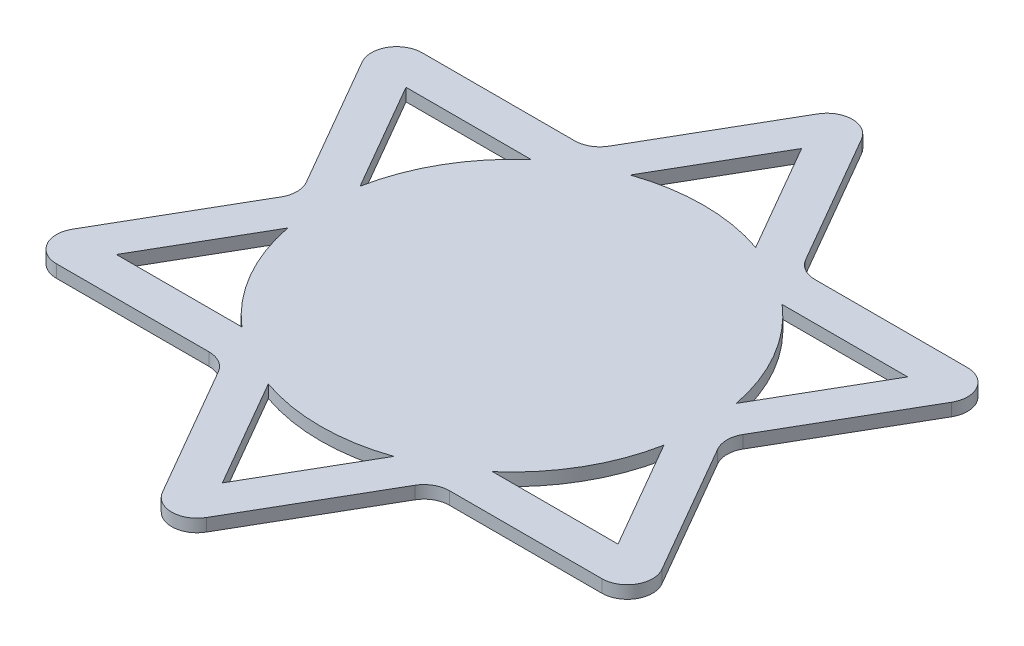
ISO-10303-21;
HEADER;
FILE_DESCRIPTION(('STEP AP214'),'2;1');
FILE_NAME('part.step','',(''),(''),'','','');
FILE_SCHEMA(('AUTOMOTIVE_DESIGN { 1 0 10303 214 1 1 1 1 }'));
ENDSEC;
DATA;
#1=APPLICATION_CONTEXT('core data for automotive mechanical design processes');
#2=APPLICATION_PROTOCOL_DEFINITION('international standard','automotive_design',2000,#1);
#3=PRODUCT_CONTEXT('',#1,'mechanical');
#4=PRODUCT('Part','Part','',(#3));
#5=PRODUCT_RELATED_PRODUCT_CATEGORY('part','',(#4));
#6=PRODUCT_DEFINITION_FORMATION('','',#4);
#7=PRODUCT_DEFINITION_CONTEXT('part definition',#1,'design');
#8=PRODUCT_DEFINITION('design','',#6,#7);
#9=PRODUCT_DEFINITION_SHAPE('','',#8);
#10=(LENGTH_UNIT() NAMED_UNIT(*) SI_UNIT(.MILLI.,.METRE.));
#11=(NAMED_UNIT(*) PLANE_ANGLE_UNIT() SI_UNIT($,.RADIAN.));
#12=(NAMED_UNIT(*) SI_UNIT($,.STERADIAN.) SOLID_ANGLE_UNIT());
#13=UNCERTAINTY_MEASURE_WITH_UNIT(LENGTH_MEASURE(1.E-05),#10,'distance_accuracy_value','');
#14=(GEOMETRIC_REPRESENTATION_CONTEXT(3) GLOBAL_UNCERTAINTY_ASSIGNED_CONTEXT((#13)) GLOBAL_UNIT_ASSIGNED_CONTEXT((#10,
#11,#12)) REPRESENTATION_CONTEXT('',''));
#15=CARTESIAN_POINT('',(0.,0.,0.));
#16=DIRECTION('',(0.,0.,1.));
#17=DIRECTION('',(1.,0.,0.));
#18=AXIS2_PLACEMENT_3D('',#15,#16,#17);
#19=CARTESIAN_POINT('',(53.4134542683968,1.,53.0877295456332));
#20=DIRECTION('',(0.,-1.,0.));
#21=DIRECTION('',(0.,0.,-1.));
#22=AXIS2_PLACEMENT_3D('',#19,#20,#21);
#23=PLANE('',#22);
#24=DIRECTION('',(-0.5,0.,0.866025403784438));
#25=VECTOR('',#24,1.);
#26=CARTESIAN_POINT('',(62.9014881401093,1.,46.6539728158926));
#27=LINE('',#26,#25);
#28=CARTESIAN_POINT('',(62.9014881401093,1.,46.6539728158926));
#29=VERTEX_POINT('',#28);
#30=CARTESIAN_POINT('',(57.9479405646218,1.,55.2337688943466));
#31=VERTEX_POINT('',#30);
#32=EDGE_CURVE('E327',#29,#31,#27,.T.);
#33=ORIENTED_EDGE('',*,*,#32,.F.);
#34=DIRECTION('',(-0.499999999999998,0.,-0.86602540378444));
#35=VECTOR('',#34,1.);
#36=CARTESIAN_POINT('',(62.9014881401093,1.,46.6539728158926));
#37=LINE('',#36,#35);
#38=CARTESIAN_POINT('',(67.8550357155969,1.,55.2337688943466));
#39=VERTEX_POINT('',#38);
#40=EDGE_CURVE('E333',#39,#29,#37,.T.);
#41=ORIENTED_EDGE('',*,*,#40,.F.);
#42=CARTESIAN_POINT('',(62.9014881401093,1.,69.5214862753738));
#43=DIRECTION('',(0.,-1.,0.));
#44=DIRECTION('',(0.,0.,1.));
#45=AXIS2_PLACEMENT_3D('',#42,#43,#44);
#46=CIRCLE('',#45,15.1220534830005);
#47=EDGE_CURVE('E329',#31,#39,#46,.T.);
#48=ORIENTED_EDGE('',*,*,#47,.F.);
#49=EDGE_LOOP('',(#33,#41,#48));
#50=FACE_BOUND('',#49,.T.);
#51=DIRECTION('',(-0.499999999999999,0.,-0.866025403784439));
#52=VECTOR('',#51,1.);
#53=CARTESIAN_POINT('',(77.7517881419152,1.,72.3754469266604));
#54=LINE('',#53,#52);
#55=CARTESIAN_POINT('',(82.7053357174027,1.,80.9552430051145));
#56=VERTEX_POINT('',#55);
#57=CARTESIAN_POINT('',(77.7517881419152,1.,72.3754469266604));
#58=VERTEX_POINT('',#57);
#59=EDGE_CURVE('E375',#56,#58,#54,.T.);
#60=ORIENTED_EDGE('',*,*,#59,.F.);
#61=DIRECTION('',(1.,0.,0.));
#62=VECTOR('',#61,1.);
#63=CARTESIAN_POINT('',(72.7982405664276,1.,80.9552430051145));
#64=LINE('',#63,#62);
#65=CARTESIAN_POINT('',(72.7982405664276,1.,80.9552430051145));
#66=VERTEX_POINT('',#65);
#67=EDGE_CURVE('E381',#66,#56,#64,.T.);
#68=ORIENTED_EDGE('',*,*,#67,.F.);
#69=CARTESIAN_POINT('',(62.9014881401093,1.,69.5214862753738));
#70=DIRECTION('',(0.,-1.,0.));
#71=DIRECTION('',(0.,0.,1.));
#72=AXIS2_PLACEMENT_3D('',#69,#70,#71);
#73=CIRCLE('',#72,15.1220534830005);
#74=EDGE_CURVE('E377',#58,#66,#73,.T.);
#75=ORIENTED_EDGE('',*,*,#74,.F.);
#76=EDGE_LOOP('',(#60,#68,#75));
#77=FACE_BOUND('',#76,.T.);
#78=DIRECTION('',(1.,0.,0.));
#79=VECTOR('',#78,1.);
#80=CARTESIAN_POINT('',(43.097640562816,1.,80.9552430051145));
#81=LINE('',#80,#79);
#82=CARTESIAN_POINT('',(43.097640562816,1.,80.9552430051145));
#83=VERTEX_POINT('',#82);
#84=CARTESIAN_POINT('',(53.004735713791,1.,80.9552430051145));
#85=VERTEX_POINT('',#84);
#86=EDGE_CURVE('E423',#83,#85,#81,.T.);
#87=ORIENTED_EDGE('',*,*,#86,.F.);
#88=DIRECTION('',(-0.5,0.,0.866025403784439));
#89=VECTOR('',#88,1.);
#90=CARTESIAN_POINT('',(48.0511881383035,1.,72.3754469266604));
#91=LINE('',#90,#89);
#92=CARTESIAN_POINT('',(48.0511881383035,1.,72.3754469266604));
#93=VERTEX_POINT('',#92);
#94=EDGE_CURVE('E429',#93,#83,#91,.T.);
#95=ORIENTED_EDGE('',*,*,#94,.F.);
#96=CARTESIAN_POINT('',(62.9014881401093,1.,69.5214862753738));
#97=DIRECTION('',(0.,-1.,0.));
#98=DIRECTION('',(0.,0.,1.));
#99=AXIS2_PLACEMENT_3D('',#96,#97,#98);
#100=CIRCLE('',#99,15.1220534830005);
#101=EDGE_CURVE('E425',#85,#93,#100,.T.);
#102=ORIENTED_EDGE('',*,*,#101,.F.);
#103=EDGE_LOOP('',(#87,#95,#102));
#104=FACE_BOUND('',#103,.T.);
#105=CARTESIAN_POINT('',(53.4134542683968,1.,53.0877295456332));
#106=DIRECTION('',(0.,-1.,0.));
#107=DIRECTION('',(0.,0.,-1.));
#108=AXIS2_PLACEMENT_3D('',#105,#106,#107);
#109=CIRCLE('',#108,2.);
#110=CARTESIAN_POINT('',(55.1455050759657,1.,54.0877295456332));
#111=VERTEX_POINT('',#110);
#112=CARTESIAN_POINT('',(53.4134542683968,1.,55.0877295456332));
#113=VERTEX_POINT('',#112);
#114=EDGE_CURVE('E447',#111,#113,#109,.T.);
#115=ORIENTED_EDGE('',*,*,#114,.T.);
#116=DIRECTION('',(-1.,0.,0.));
#117=VECTOR('',#116,1.);
#118=CARTESIAN_POINT('',(41.3655897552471,1.,55.0877295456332));
#119=LINE('',#118,#117);
#120=CARTESIAN_POINT('',(41.3655897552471,1.,55.0877295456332));
#121=VERTEX_POINT('',#120);
#122=EDGE_CURVE('E450',#113,#121,#119,.T.);
#123=ORIENTED_EDGE('',*,*,#122,.T.);
#124=CARTESIAN_POINT('',(41.3655897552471,1.,57.0877295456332));
#125=DIRECTION('',(0.,1.,0.));
#126=DIRECTION('',(0.,0.,-1.));
#127=AXIS2_PLACEMENT_3D('',#124,#125,#126);
#128=CIRCLE('',#127,2.);
#129=CARTESIAN_POINT('',(39.6335389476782,1.,58.0877295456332));
#130=VERTEX_POINT('',#129);
#131=EDGE_CURVE('E453',#121,#130,#128,.T.);
#132=ORIENTED_EDGE('',*,*,#131,.T.);
#133=DIRECTION('',(0.499999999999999,0.,0.866025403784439));
#134=VECTOR('',#133,1.);
#135=CARTESIAN_POINT('',(39.6335389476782,1.,58.0877295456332));
#136=LINE('',#135,#134);
#137=CARTESIAN_POINT('',(45.657471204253,1.,68.5214862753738));
#138=VERTEX_POINT('',#137);
#139=EDGE_CURVE('E455',#130,#138,#136,.T.);
#140=ORIENTED_EDGE('',*,*,#139,.T.);
#141=CARTESIAN_POINT('',(43.9254203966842,1.,69.5214862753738));
#142=DIRECTION('',(0.,-1.,0.));
#143=DIRECTION('',(0.,0.,1.));
#144=AXIS2_PLACEMENT_3D('',#141,#142,#143);
#145=CIRCLE('',#144,2.);
#146=CARTESIAN_POINT('',(45.657471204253,1.,70.5214862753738));
#147=VERTEX_POINT('',#146);
#148=EDGE_CURVE('E457',#138,#147,#145,.T.);
#149=ORIENTED_EDGE('',*,*,#148,.T.);
#150=DIRECTION('',(-0.499999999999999,0.,0.866025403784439));
#151=VECTOR('',#150,1.);
#152=CARTESIAN_POINT('',(45.657471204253,1.,70.5214862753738));
#153=LINE('',#152,#151);
#154=CARTESIAN_POINT('',(39.6335389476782,1.,80.9552430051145));
#155=VERTEX_POINT('',#154);
#156=EDGE_CURVE('E459',#147,#155,#153,.T.);
#157=ORIENTED_EDGE('',*,*,#156,.T.);
#158=CARTESIAN_POINT('',(41.3655897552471,1.,81.9552430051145));
#159=DIRECTION('',(0.,1.,0.));
#160=DIRECTION('',(0.,0.,-1.));
#161=AXIS2_PLACEMENT_3D('',#158,#159,#160);
#162=CIRCLE('',#161,2.);
#163=CARTESIAN_POINT('',(41.3655897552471,1.,83.9552430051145));
#164=VERTEX_POINT('',#163);
#165=EDGE_CURVE('E461',#155,#164,#162,.T.);
#166=ORIENTED_EDGE('',*,*,#165,.T.);
#167=DIRECTION('',(1.,0.,0.));
#168=VECTOR('',#167,1.);
#169=CARTESIAN_POINT('',(41.3655897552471,1.,83.9552430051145));
#170=LINE('',#169,#168);
#171=CARTESIAN_POINT('',(53.4134542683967,1.,83.9552430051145));
#172=VERTEX_POINT('',#171);
#173=EDGE_CURVE('E463',#164,#172,#170,.T.);
#174=ORIENTED_EDGE('',*,*,#173,.T.);
#175=CARTESIAN_POINT('',(53.4134542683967,1.,85.9552430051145));
#176=DIRECTION('',(0.,-1.,0.));
#177=DIRECTION('',(0.,0.,-1.));
#178=AXIS2_PLACEMENT_3D('',#175,#176,#177);
#179=CIRCLE('',#178,2.);
#180=CARTESIAN_POINT('',(55.1455050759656,1.,84.9552430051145));
#181=VERTEX_POINT('',#180);
#182=EDGE_CURVE('E465',#172,#181,#179,.T.);
#183=ORIENTED_EDGE('',*,*,#182,.T.);
#184=DIRECTION('',(0.499999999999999,0.,0.866025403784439));
#185=VECTOR('',#184,1.);
#186=CARTESIAN_POINT('',(55.1455050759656,1.,84.9552430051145));
#187=LINE('',#186,#185);
#188=CARTESIAN_POINT('',(61.1694373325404,1.,95.3889997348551));
#189=VERTEX_POINT('',#188);
#190=EDGE_CURVE('E467',#181,#189,#187,.T.);
#191=ORIENTED_EDGE('',*,*,#190,.T.);
#192=CARTESIAN_POINT('',(62.9014881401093,1.,94.3889997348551));
#193=DIRECTION('',(0.,1.,0.));
#194=DIRECTION('',(0.,0.,-1.));
#195=AXIS2_PLACEMENT_3D('',#192,#193,#194);
#196=CIRCLE('',#195,2.);
#197=CARTESIAN_POINT('',(64.6335389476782,1.,95.3889997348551));
#198=VERTEX_POINT('',#197);
#199=EDGE_CURVE('E469',#189,#198,#196,.T.);
#200=ORIENTED_EDGE('',*,*,#199,.T.);
#201=DIRECTION('',(0.5,0.,-0.866025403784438));
#202=VECTOR('',#201,1.);
#203=CARTESIAN_POINT('',(70.657471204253,1.,84.9552430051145));
#204=LINE('',#203,#202);
#205=CARTESIAN_POINT('',(70.657471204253,1.,84.9552430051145));
#206=VERTEX_POINT('',#205);
#207=EDGE_CURVE('E471',#198,#206,#204,.T.);
#208=ORIENTED_EDGE('',*,*,#207,.T.);
#209=CARTESIAN_POINT('',(72.3895220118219,1.,85.9552430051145));
#210=DIRECTION('',(0.,-1.,0.));
#211=DIRECTION('',(0.,0.,1.));
#212=AXIS2_PLACEMENT_3D('',#209,#210,#211);
#213=CIRCLE('',#212,2.);
#214=CARTESIAN_POINT('',(72.3895220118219,1.,83.9552430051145));
#215=VERTEX_POINT('',#214);
#216=EDGE_CURVE('E473',#206,#215,#213,.T.);
#217=ORIENTED_EDGE('',*,*,#216,.T.);
#218=DIRECTION('',(1.,0.,0.));
#219=VECTOR('',#218,1.);
#220=CARTESIAN_POINT('',(72.3895220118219,1.,83.9552430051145));
#221=LINE('',#220,#219);
#222=CARTESIAN_POINT('',(84.4373865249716,1.,83.9552430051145));
#223=VERTEX_POINT('',#222);
#224=EDGE_CURVE('E475',#215,#223,#221,.T.);
#225=ORIENTED_EDGE('',*,*,#224,.T.);
#226=CARTESIAN_POINT('',(84.4373865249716,1.,81.9552430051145));
#227=DIRECTION('',(0.,1.,0.));
#228=DIRECTION('',(0.,0.,-1.));
#229=AXIS2_PLACEMENT_3D('',#226,#227,#228);
#230=CIRCLE('',#229,2.00000000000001);
#231=CARTESIAN_POINT('',(86.1694373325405,1.,80.9552430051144));
#232=VERTEX_POINT('',#231);
#233=EDGE_CURVE('E477',#223,#232,#230,.T.);
#234=ORIENTED_EDGE('',*,*,#233,.T.);
#235=DIRECTION('',(-0.5,0.,-0.866025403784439));
#236=VECTOR('',#235,1.);
#237=CARTESIAN_POINT('',(80.1455050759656,1.,70.5214862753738));
#238=LINE('',#237,#236);
#239=CARTESIAN_POINT('',(80.1455050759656,1.,70.5214862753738));
#240=VERTEX_POINT('',#239);
#241=EDGE_CURVE('E479',#232,#240,#238,.T.);
#242=ORIENTED_EDGE('',*,*,#241,.T.);
#243=CARTESIAN_POINT('',(81.8775558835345,1.,69.5214862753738));
#244=DIRECTION('',(0.,-1.,0.));
#245=DIRECTION('',(0.,0.,-1.));
#246=AXIS2_PLACEMENT_3D('',#243,#244,#245);
#247=CIRCLE('',#246,2.);
#248=CARTESIAN_POINT('',(80.1455050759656,1.,68.5214862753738));
#249=VERTEX_POINT('',#248);
#250=EDGE_CURVE('E481',#240,#249,#247,.T.);
#251=ORIENTED_EDGE('',*,*,#250,.T.);
#252=DIRECTION('',(0.500000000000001,0.,-0.866025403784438));
#253=VECTOR('',#252,1.);
#254=CARTESIAN_POINT('',(86.1694373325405,1.,58.0877295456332));
#255=LINE('',#254,#253);
#256=CARTESIAN_POINT('',(86.1694373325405,1.,58.0877295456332));
#257=VERTEX_POINT('',#256);
#258=EDGE_CURVE('E483',#249,#257,#255,.T.);
#259=ORIENTED_EDGE('',*,*,#258,.T.);
#260=CARTESIAN_POINT('',(84.4373865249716,1.,57.0877295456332));
#261=DIRECTION('',(0.,1.,0.));
#262=DIRECTION('',(0.,0.,-1.));
#263=AXIS2_PLACEMENT_3D('',#260,#261,#262);
#264=CIRCLE('',#263,2.);
#265=CARTESIAN_POINT('',(84.4373865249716,1.,55.0877295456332));
#266=VERTEX_POINT('',#265);
#267=EDGE_CURVE('E485',#257,#266,#264,.T.);
#268=ORIENTED_EDGE('',*,*,#267,.T.);
#269=DIRECTION('',(-1.,0.,0.));
#270=VECTOR('',#269,1.);
#271=CARTESIAN_POINT('',(72.3895220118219,1.,55.0877295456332));
#272=LINE('',#271,#270);
#273=CARTESIAN_POINT('',(72.3895220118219,1.,55.0877295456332));
#274=VERTEX_POINT('',#273);
#275=EDGE_CURVE('E487',#266,#274,#272,.T.);
#276=ORIENTED_EDGE('',*,*,#275,.T.);
#277=CARTESIAN_POINT('',(72.3895220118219,1.,53.0877295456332));
#278=DIRECTION('',(0.,-1.,0.));
#279=DIRECTION('',(0.,0.,-1.));
#280=AXIS2_PLACEMENT_3D('',#277,#278,#279);
#281=CIRCLE('',#280,2.);
#282=CARTESIAN_POINT('',(70.657471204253,1.,54.0877295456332));
#283=VERTEX_POINT('',#282);
#284=EDGE_CURVE('E489',#274,#283,#281,.T.);
#285=ORIENTED_EDGE('',*,*,#284,.T.);
#286=DIRECTION('',(-0.5,0.,-0.866025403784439));
#287=VECTOR('',#286,1.);
#288=CARTESIAN_POINT('',(64.6335389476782,1.,43.6539728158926));
#289=LINE('',#288,#287);
#290=CARTESIAN_POINT('',(64.6335389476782,1.,43.6539728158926));
#291=VERTEX_POINT('',#290);
#292=EDGE_CURVE('E491',#283,#291,#289,.T.);
#293=ORIENTED_EDGE('',*,*,#292,.T.);
#294=CARTESIAN_POINT('',(62.9014881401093,1.,44.6539728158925));
#295=DIRECTION('',(0.,1.,0.));
#296=DIRECTION('',(0.,0.,-1.));
#297=AXIS2_PLACEMENT_3D('',#294,#295,#296);
#298=CIRCLE('',#297,2.);
#299=CARTESIAN_POINT('',(61.1694373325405,1.,43.6539728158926));
#300=VERTEX_POINT('',#299);
#301=EDGE_CURVE('E493',#291,#300,#298,.T.);
#302=ORIENTED_EDGE('',*,*,#301,.T.);
#303=DIRECTION('',(-0.5,0.,0.866025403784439));
#304=VECTOR('',#303,1.);
#305=CARTESIAN_POINT('',(61.1694373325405,1.,43.6539728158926));
#306=LINE('',#305,#304);
#307=EDGE_CURVE('E495',#300,#111,#306,.T.);
#308=ORIENTED_EDGE('',*,*,#307,.T.);
#309=EDGE_LOOP('',(#115,#123,#132,#140,#149,#157,#166,#174,#183,#191,#200,#208,#217,#225,#234,
#242,#251,#259,#268,#276,#285,#293,#302,#308));
#310=FACE_BOUND('',#309,.T.);
#311=DIRECTION('',(0.5,0.,-0.866025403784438));
#312=VECTOR('',#311,1.);
#313=CARTESIAN_POINT('',(67.8550357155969,1.,83.8092036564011));
#314=LINE('',#313,#312);
#315=CARTESIAN_POINT('',(62.9014881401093,1.,92.3889997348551));
#316=VERTEX_POINT('',#315);
#317=CARTESIAN_POINT('',(67.8550357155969,1.,83.8092036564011));
#318=VERTEX_POINT('',#317);
#319=EDGE_CURVE('E399',#316,#318,#314,.T.);
#320=ORIENTED_EDGE('',*,*,#319,.F.);
#321=DIRECTION('',(0.500000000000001,0.,0.866025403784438));
#322=VECTOR('',#321,1.);
#323=CARTESIAN_POINT('',(57.9479405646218,1.,83.8092036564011));
#324=LINE('',#323,#322);
#325=CARTESIAN_POINT('',(57.9479405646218,1.,83.8092036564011));
#326=VERTEX_POINT('',#325);
#327=EDGE_CURVE('E405',#326,#316,#324,.T.);
#328=ORIENTED_EDGE('',*,*,#327,.F.);
#329=CARTESIAN_POINT('',(62.9014881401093,1.,69.5214862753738));
#330=DIRECTION('',(0.,-1.,0.));
#331=DIRECTION('',(0.,0.,1.));
#332=AXIS2_PLACEMENT_3D('',#329,#330,#331);
#333=CIRCLE('',#332,15.1220534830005);
#334=EDGE_CURVE('E401',#318,#326,#333,.T.);
#335=ORIENTED_EDGE('',*,*,#334,.F.);
#336=EDGE_LOOP('',(#320,#328,#335));
#337=FACE_BOUND('',#336,.T.);
#338=DIRECTION('',(-1.,0.,0.));
#339=VECTOR('',#338,1.);
#340=CARTESIAN_POINT('',(72.7982405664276,1.,58.0877295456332));
#341=LINE('',#340,#339);
#342=CARTESIAN_POINT('',(82.7053357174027,1.,58.0877295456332));
#343=VERTEX_POINT('',#342);
#344=CARTESIAN_POINT('',(72.7982405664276,1.,58.0877295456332));
#345=VERTEX_POINT('',#344);
#346=EDGE_CURVE('E351',#343,#345,#341,.T.);
#347=ORIENTED_EDGE('',*,*,#346,.F.);
#348=DIRECTION('',(0.500000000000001,0.,-0.866025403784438));
#349=VECTOR('',#348,1.);
#350=CARTESIAN_POINT('',(82.7053357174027,1.,58.0877295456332));
#351=LINE('',#350,#349);
#352=CARTESIAN_POINT('',(77.7517881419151,1.,66.6675256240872));
#353=VERTEX_POINT('',#352);
#354=EDGE_CURVE('E357',#353,#343,#351,.T.);
#355=ORIENTED_EDGE('',*,*,#354,.F.);
#356=CARTESIAN_POINT('',(62.9014881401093,1.,69.5214862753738));
#357=DIRECTION('',(0.,-1.,0.));
#358=DIRECTION('',(0.,0.,1.));
#359=AXIS2_PLACEMENT_3D('',#356,#357,#358);
#360=CIRCLE('',#359,15.1220534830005);
#361=EDGE_CURVE('E353',#345,#353,#360,.T.);
#362=ORIENTED_EDGE('',*,*,#361,.F.);
#363=EDGE_LOOP('',(#347,#355,#362));
#364=FACE_BOUND('',#363,.T.);
#365=DIRECTION('',(0.5,0.,0.866025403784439));
#366=VECTOR('',#365,1.);
#367=CARTESIAN_POINT('',(43.097640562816,1.,58.0877295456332));
#368=LINE('',#367,#366);
#369=CARTESIAN_POINT('',(43.097640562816,1.,58.0877295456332));
#370=VERTEX_POINT('',#369);
#371=CARTESIAN_POINT('',(48.0511881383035,1.,66.6675256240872));
#372=VERTEX_POINT('',#371);
#373=EDGE_CURVE('E300',#370,#372,#368,.T.);
#374=ORIENTED_EDGE('',*,*,#373,.F.);
#375=DIRECTION('',(-1.,0.,0.));
#376=VECTOR('',#375,1.);
#377=CARTESIAN_POINT('',(43.097640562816,1.,58.0877295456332));
#378=LINE('',#377,#376);
#379=CARTESIAN_POINT('',(53.004735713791,1.,58.0877295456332));
#380=VERTEX_POINT('',#379);
#381=EDGE_CURVE('E317',#380,#370,#378,.T.);
#382=ORIENTED_EDGE('',*,*,#381,.F.);
#383=CARTESIAN_POINT('',(62.9014881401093,1.,69.5214862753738));
#384=DIRECTION('',(0.,-1.,0.));
#385=DIRECTION('',(0.,0.,1.));
#386=AXIS2_PLACEMENT_3D('',#383,#384,#385);
#387=CIRCLE('',#386,15.1220534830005);
#388=EDGE_CURVE('E308',#372,#380,#387,.T.);
#389=ORIENTED_EDGE('',*,*,#388,.F.);
#390=EDGE_LOOP('',(#374,#382,#389));
#391=FACE_BOUND('',#390,.T.);
#392=ADVANCED_FACE('F31',(#50,#77,#104,#310,#337,#364,#391),#23,.F.);
#393=CARTESIAN_POINT('',(53.4134542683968,0.,53.0877295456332));
#394=DIRECTION('',(0.,-1.,0.));
#395=DIRECTION('',(0.,0.,-1.));
#396=AXIS2_PLACEMENT_3D('',#393,#394,#395);
#397=PLANE('',#396);
#398=DIRECTION('',(-0.499999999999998,0.,-0.86602540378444));
#399=VECTOR('',#398,1.);
#400=CARTESIAN_POINT('',(62.9014881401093,0.,46.6539728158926));
#401=LINE('',#400,#399);
#402=CARTESIAN_POINT('',(67.8550357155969,0.,55.2337688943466));
#403=VERTEX_POINT('',#402);
#404=CARTESIAN_POINT('',(62.9014881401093,0.,46.6539728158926));
#405=VERTEX_POINT('',#404);
#406=EDGE_CURVE('E330',#403,#405,#401,.T.);
#407=ORIENTED_EDGE('',*,*,#406,.T.);
#408=DIRECTION('',(-0.5,0.,0.866025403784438));
#409=VECTOR('',#408,1.);
#410=CARTESIAN_POINT('',(62.9014881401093,0.,46.6539728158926));
#411=LINE('',#410,#409);
#412=CARTESIAN_POINT('',(57.9479405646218,0.,55.2337688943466));
#413=VERTEX_POINT('',#412);
#414=EDGE_CURVE('E315',#405,#413,#411,.T.);
#415=ORIENTED_EDGE('',*,*,#414,.T.);
#416=CARTESIAN_POINT('',(62.9014881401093,0.,69.5214862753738));
#417=DIRECTION('',(0.,-1.,0.));
#418=DIRECTION('',(0.,0.,1.));
#419=AXIS2_PLACEMENT_3D('',#416,#417,#418);
#420=CIRCLE('',#419,15.1220534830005);
#421=EDGE_CURVE('E338',#413,#403,#420,.T.);
#422=ORIENTED_EDGE('',*,*,#421,.T.);
#423=EDGE_LOOP('',(#407,#415,#422));
#424=FACE_BOUND('',#423,.T.);
#425=DIRECTION('',(1.,0.,0.));
#426=VECTOR('',#425,1.);
#427=CARTESIAN_POINT('',(72.7982405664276,0.,80.9552430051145));
#428=LINE('',#427,#426);
#429=CARTESIAN_POINT('',(72.7982405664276,0.,80.9552430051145));
#430=VERTEX_POINT('',#429);
#431=CARTESIAN_POINT('',(82.7053357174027,0.,80.9552430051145));
#432=VERTEX_POINT('',#431);
#433=EDGE_CURVE('E378',#430,#432,#428,.T.);
#434=ORIENTED_EDGE('',*,*,#433,.T.);
#435=DIRECTION('',(-0.499999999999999,0.,-0.866025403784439));
#436=VECTOR('',#435,1.);
#437=CARTESIAN_POINT('',(77.7517881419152,0.,72.3754469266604));
#438=LINE('',#437,#436);
#439=CARTESIAN_POINT('',(77.7517881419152,0.,72.3754469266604));
#440=VERTEX_POINT('',#439);
#441=EDGE_CURVE('E374',#432,#440,#438,.T.);
#442=ORIENTED_EDGE('',*,*,#441,.T.);
#443=CARTESIAN_POINT('',(62.9014881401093,0.,69.5214862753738));
#444=DIRECTION('',(0.,-1.,0.));
#445=DIRECTION('',(0.,0.,1.));
#446=AXIS2_PLACEMENT_3D('',#443,#444,#445);
#447=CIRCLE('',#446,15.1220534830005);
#448=EDGE_CURVE('E386',#440,#430,#447,.T.);
#449=ORIENTED_EDGE('',*,*,#448,.T.);
#450=EDGE_LOOP('',(#434,#442,#449));
#451=FACE_BOUND('',#450,.T.);
#452=DIRECTION('',(-0.5,0.,0.866025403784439));
#453=VECTOR('',#452,1.);
#454=CARTESIAN_POINT('',(48.0511881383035,0.,72.3754469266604));
#455=LINE('',#454,#453);
#456=CARTESIAN_POINT('',(48.0511881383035,0.,72.3754469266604));
#457=VERTEX_POINT('',#456);
#458=CARTESIAN_POINT('',(43.097640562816,0.,80.9552430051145));
#459=VERTEX_POINT('',#458);
#460=EDGE_CURVE('E426',#457,#459,#455,.T.);
#461=ORIENTED_EDGE('',*,*,#460,.T.);
#462=DIRECTION('',(1.,0.,0.));
#463=VECTOR('',#462,1.);
#464=CARTESIAN_POINT('',(43.097640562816,0.,80.9552430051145));
#465=LINE('',#464,#463);
#466=CARTESIAN_POINT('',(53.004735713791,0.,80.9552430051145));
#467=VERTEX_POINT('',#466);
#468=EDGE_CURVE('E422',#459,#467,#465,.T.);
#469=ORIENTED_EDGE('',*,*,#468,.T.);
#470=CARTESIAN_POINT('',(62.9014881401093,0.,69.5214862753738));
#471=DIRECTION('',(0.,-1.,0.));
#472=DIRECTION('',(0.,0.,1.));
#473=AXIS2_PLACEMENT_3D('',#470,#471,#472);
#474=CIRCLE('',#473,15.1220534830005);
#475=EDGE_CURVE('E434',#467,#457,#474,.T.);
#476=ORIENTED_EDGE('',*,*,#475,.T.);
#477=EDGE_LOOP('',(#461,#469,#476));
#478=FACE_BOUND('',#477,.T.);
#479=CARTESIAN_POINT('',(53.4134542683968,0.,53.0877295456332));
#480=DIRECTION('',(0.,-1.,0.));
#481=DIRECTION('',(0.,0.,-1.));
#482=AXIS2_PLACEMENT_3D('',#479,#480,#481);
#483=CIRCLE('',#482,2.);
#484=CARTESIAN_POINT('',(55.1455050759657,0.,54.0877295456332));
#485=VERTEX_POINT('',#484);
#486=CARTESIAN_POINT('',(53.4134542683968,0.,55.0877295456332));
#487=VERTEX_POINT('',#486);
#488=EDGE_CURVE('E446',#485,#487,#483,.T.);
#489=ORIENTED_EDGE('',*,*,#488,.F.);
#490=DIRECTION('',(-0.5,0.,0.866025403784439));
#491=VECTOR('',#490,1.);
#492=CARTESIAN_POINT('',(61.1694373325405,0.,43.6539728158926));
#493=LINE('',#492,#491);
#494=CARTESIAN_POINT('',(61.1694373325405,0.,43.6539728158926));
#495=VERTEX_POINT('',#494);
#496=EDGE_CURVE('E451',#495,#485,#493,.T.);
#497=ORIENTED_EDGE('',*,*,#496,.F.);
#498=CARTESIAN_POINT('',(62.9014881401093,0.,44.6539728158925));
#499=DIRECTION('',(0.,1.,0.));
#500=DIRECTION('',(0.,0.,-1.));
#501=AXIS2_PLACEMENT_3D('',#498,#499,#500);
#502=CIRCLE('',#501,2.);
#503=CARTESIAN_POINT('',(64.6335389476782,0.,43.6539728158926));
#504=VERTEX_POINT('',#503);
#505=EDGE_CURVE('E542',#504,#495,#502,.T.);
#506=ORIENTED_EDGE('',*,*,#505,.F.);
#507=DIRECTION('',(-0.5,0.,-0.866025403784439));
#508=VECTOR('',#507,1.);
#509=CARTESIAN_POINT('',(64.6335389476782,0.,43.6539728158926));
#510=LINE('',#509,#508);
#511=CARTESIAN_POINT('',(70.657471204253,0.,54.0877295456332));
#512=VERTEX_POINT('',#511);
#513=EDGE_CURVE('E540',#512,#504,#510,.T.);
#514=ORIENTED_EDGE('',*,*,#513,.F.);
#515=CARTESIAN_POINT('',(72.3895220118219,0.,53.0877295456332));
#516=DIRECTION('',(0.,-1.,0.));
#517=DIRECTION('',(0.,0.,-1.));
#518=AXIS2_PLACEMENT_3D('',#515,#516,#517);
#519=CIRCLE('',#518,2.);
#520=CARTESIAN_POINT('',(72.3895220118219,0.,55.0877295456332));
#521=VERTEX_POINT('',#520);
#522=EDGE_CURVE('E538',#521,#512,#519,.T.);
#523=ORIENTED_EDGE('',*,*,#522,.F.);
#524=DIRECTION('',(-1.,0.,0.));
#525=VECTOR('',#524,1.);
#526=CARTESIAN_POINT('',(72.3895220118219,0.,55.0877295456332));
#527=LINE('',#526,#525);
#528=CARTESIAN_POINT('',(84.4373865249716,0.,55.0877295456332));
#529=VERTEX_POINT('',#528);
#530=EDGE_CURVE('E536',#529,#521,#527,.T.);
#531=ORIENTED_EDGE('',*,*,#530,.F.);
#532=CARTESIAN_POINT('',(84.4373865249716,0.,57.0877295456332));
#533=DIRECTION('',(0.,1.,0.));
#534=DIRECTION('',(0.,0.,-1.));
#535=AXIS2_PLACEMENT_3D('',#532,#533,#534);
#536=CIRCLE('',#535,2.);
#537=CARTESIAN_POINT('',(86.1694373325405,0.,58.0877295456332));
#538=VERTEX_POINT('',#537);
#539=EDGE_CURVE('E534',#538,#529,#536,.T.);
#540=ORIENTED_EDGE('',*,*,#539,.F.);
#541=DIRECTION('',(0.500000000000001,0.,-0.866025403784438));
#542=VECTOR('',#541,1.);
#543=CARTESIAN_POINT('',(86.1694373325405,0.,58.0877295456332));
#544=LINE('',#543,#542);
#545=CARTESIAN_POINT('',(80.1455050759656,0.,68.5214862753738));
#546=VERTEX_POINT('',#545);
#547=EDGE_CURVE('E532',#546,#538,#544,.T.);
#548=ORIENTED_EDGE('',*,*,#547,.F.);
#549=CARTESIAN_POINT('',(81.8775558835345,0.,69.5214862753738));
#550=DIRECTION('',(0.,-1.,0.));
#551=DIRECTION('',(0.,0.,-1.));
#552=AXIS2_PLACEMENT_3D('',#549,#550,#551);
#553=CIRCLE('',#552,2.);
#554=CARTESIAN_POINT('',(80.1455050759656,0.,70.5214862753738));
#555=VERTEX_POINT('',#554);
#556=EDGE_CURVE('E530',#555,#546,#553,.T.);
#557=ORIENTED_EDGE('',*,*,#556,.F.);
#558=DIRECTION('',(-0.5,0.,-0.866025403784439));
#559=VECTOR('',#558,1.);
#560=CARTESIAN_POINT('',(80.1455050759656,0.,70.5214862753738));
#561=LINE('',#560,#559);
#562=CARTESIAN_POINT('',(86.1694373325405,0.,80.9552430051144));
#563=VERTEX_POINT('',#562);
#564=EDGE_CURVE('E528',#563,#555,#561,.T.);
#565=ORIENTED_EDGE('',*,*,#564,.F.);
#566=CARTESIAN_POINT('',(84.4373865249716,0.,81.9552430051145));
#567=DIRECTION('',(0.,1.,0.));
#568=DIRECTION('',(0.,0.,-1.));
#569=AXIS2_PLACEMENT_3D('',#566,#567,#568);
#570=CIRCLE('',#569,2.00000000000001);
#571=CARTESIAN_POINT('',(84.4373865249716,0.,83.9552430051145));
#572=VERTEX_POINT('',#571);
#573=EDGE_CURVE('E526',#572,#563,#570,.T.);
#574=ORIENTED_EDGE('',*,*,#573,.F.);
#575=DIRECTION('',(1.,0.,0.));
#576=VECTOR('',#575,1.);
#577=CARTESIAN_POINT('',(72.3895220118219,0.,83.9552430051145));
#578=LINE('',#577,#576);
#579=CARTESIAN_POINT('',(72.3895220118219,0.,83.9552430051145));
#580=VERTEX_POINT('',#579);
#581=EDGE_CURVE('E524',#580,#572,#578,.T.);
#582=ORIENTED_EDGE('',*,*,#581,.F.);
#583=CARTESIAN_POINT('',(72.3895220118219,0.,85.9552430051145));
#584=DIRECTION('',(0.,-1.,0.));
#585=DIRECTION('',(0.,0.,1.));
#586=AXIS2_PLACEMENT_3D('',#583,#584,#585);
#587=CIRCLE('',#586,2.);
#588=CARTESIAN_POINT('',(70.657471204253,0.,84.9552430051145));
#589=VERTEX_POINT('',#588);
#590=EDGE_CURVE('E522',#589,#580,#587,.T.);
#591=ORIENTED_EDGE('',*,*,#590,.F.);
#592=DIRECTION('',(0.5,0.,-0.866025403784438));
#593=VECTOR('',#592,1.);
#594=CARTESIAN_POINT('',(70.657471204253,0.,84.9552430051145));
#595=LINE('',#594,#593);
#596=CARTESIAN_POINT('',(64.6335389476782,0.,95.3889997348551));
#597=VERTEX_POINT('',#596);
#598=EDGE_CURVE('E520',#597,#589,#595,.T.);
#599=ORIENTED_EDGE('',*,*,#598,.F.);
#600=CARTESIAN_POINT('',(62.9014881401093,0.,94.3889997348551));
#601=DIRECTION('',(0.,1.,0.));
#602=DIRECTION('',(0.,0.,-1.));
#603=AXIS2_PLACEMENT_3D('',#600,#601,#602);
#604=CIRCLE('',#603,2.);
#605=CARTESIAN_POINT('',(61.1694373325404,0.,95.3889997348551));
#606=VERTEX_POINT('',#605);
#607=EDGE_CURVE('E518',#606,#597,#604,.T.);
#608=ORIENTED_EDGE('',*,*,#607,.F.);
#609=DIRECTION('',(0.499999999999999,0.,0.866025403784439));
#610=VECTOR('',#609,1.);
#611=CARTESIAN_POINT('',(55.1455050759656,0.,84.9552430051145));
#612=LINE('',#611,#610);
#613=CARTESIAN_POINT('',(55.1455050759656,0.,84.9552430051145));
#614=VERTEX_POINT('',#613);
#615=EDGE_CURVE('E516',#614,#606,#612,.T.);
#616=ORIENTED_EDGE('',*,*,#615,.F.);
#617=CARTESIAN_POINT('',(53.4134542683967,0.,85.9552430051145));
#618=DIRECTION('',(0.,-1.,0.));
#619=DIRECTION('',(0.,0.,-1.));
#620=AXIS2_PLACEMENT_3D('',#617,#618,#619);
#621=CIRCLE('',#620,2.);
#622=CARTESIAN_POINT('',(53.4134542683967,0.,83.9552430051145));
#623=VERTEX_POINT('',#622);
#624=EDGE_CURVE('E514',#623,#614,#621,.T.);
#625=ORIENTED_EDGE('',*,*,#624,.F.);
#626=DIRECTION('',(1.,0.,0.));
#627=VECTOR('',#626,1.);
#628=CARTESIAN_POINT('',(41.3655897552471,0.,83.9552430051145));
#629=LINE('',#628,#627);
#630=CARTESIAN_POINT('',(41.3655897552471,0.,83.9552430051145));
#631=VERTEX_POINT('',#630);
#632=EDGE_CURVE('E512',#631,#623,#629,.T.);
#633=ORIENTED_EDGE('',*,*,#632,.F.);
#634=CARTESIAN_POINT('',(41.3655897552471,0.,81.9552430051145));
#635=DIRECTION('',(0.,1.,0.));
#636=DIRECTION('',(0.,0.,-1.));
#637=AXIS2_PLACEMENT_3D('',#634,#635,#636);
#638=CIRCLE('',#637,2.);
#639=CARTESIAN_POINT('',(39.6335389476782,0.,80.9552430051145));
#640=VERTEX_POINT('',#639);
#641=EDGE_CURVE('E510',#640,#631,#638,.T.);
#642=ORIENTED_EDGE('',*,*,#641,.F.);
#643=DIRECTION('',(-0.499999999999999,0.,0.866025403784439));
#644=VECTOR('',#643,1.);
#645=CARTESIAN_POINT('',(45.657471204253,0.,70.5214862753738));
#646=LINE('',#645,#644);
#647=CARTESIAN_POINT('',(45.657471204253,0.,70.5214862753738));
#648=VERTEX_POINT('',#647);
#649=EDGE_CURVE('E508',#648,#640,#646,.T.);
#650=ORIENTED_EDGE('',*,*,#649,.F.);
#651=CARTESIAN_POINT('',(43.9254203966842,0.,69.5214862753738));
#652=DIRECTION('',(0.,-1.,0.));
#653=DIRECTION('',(0.,0.,1.));
#654=AXIS2_PLACEMENT_3D('',#651,#652,#653);
#655=CIRCLE('',#654,2.);
#656=CARTESIAN_POINT('',(45.657471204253,0.,68.5214862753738));
#657=VERTEX_POINT('',#656);
#658=EDGE_CURVE('E506',#657,#648,#655,.T.);
#659=ORIENTED_EDGE('',*,*,#658,.F.);
#660=DIRECTION('',(0.499999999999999,0.,0.866025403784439));
#661=VECTOR('',#660,1.);
#662=CARTESIAN_POINT('',(39.6335389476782,0.,58.0877295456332));
#663=LINE('',#662,#661);
#664=CARTESIAN_POINT('',(39.6335389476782,0.,58.0877295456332));
#665=VERTEX_POINT('',#664);
#666=EDGE_CURVE('E504',#665,#657,#663,.T.);
#667=ORIENTED_EDGE('',*,*,#666,.F.);
#668=CARTESIAN_POINT('',(41.3655897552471,0.,57.0877295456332));
#669=DIRECTION('',(0.,1.,0.));
#670=DIRECTION('',(0.,0.,-1.));
#671=AXIS2_PLACEMENT_3D('',#668,#669,#670);
#672=CIRCLE('',#671,2.);
#673=CARTESIAN_POINT('',(41.3655897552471,0.,55.0877295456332));
#674=VERTEX_POINT('',#673);
#675=EDGE_CURVE('E502',#674,#665,#672,.T.);
#676=ORIENTED_EDGE('',*,*,#675,.F.);
#677=DIRECTION('',(-1.,0.,0.));
#678=VECTOR('',#677,1.);
#679=CARTESIAN_POINT('',(41.3655897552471,0.,55.0877295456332));
#680=LINE('',#679,#678);
#681=EDGE_CURVE('E500',#487,#674,#680,.T.);
#682=ORIENTED_EDGE('',*,*,#681,.F.);
#683=EDGE_LOOP('',(#489,#497,#506,#514,#523,#531,#540,#548,#557,#565,#574,#582,#591,#599,#608,
#616,#625,#633,#642,#650,#659,#667,#676,#682));
#684=FACE_BOUND('',#683,.T.);
#685=DIRECTION('',(0.500000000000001,0.,0.866025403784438));
#686=VECTOR('',#685,1.);
#687=CARTESIAN_POINT('',(57.9479405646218,0.,83.8092036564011));
#688=LINE('',#687,#686);
#689=CARTESIAN_POINT('',(57.9479405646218,0.,83.8092036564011));
#690=VERTEX_POINT('',#689);
#691=CARTESIAN_POINT('',(62.9014881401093,0.,92.3889997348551));
#692=VERTEX_POINT('',#691);
#693=EDGE_CURVE('E402',#690,#692,#688,.T.);
#694=ORIENTED_EDGE('',*,*,#693,.T.);
#695=DIRECTION('',(0.5,0.,-0.866025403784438));
#696=VECTOR('',#695,1.);
#697=CARTESIAN_POINT('',(67.8550357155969,0.,83.8092036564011));
#698=LINE('',#697,#696);
#699=CARTESIAN_POINT('',(67.8550357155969,0.,83.8092036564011));
#700=VERTEX_POINT('',#699);
#701=EDGE_CURVE('E398',#692,#700,#698,.T.);
#702=ORIENTED_EDGE('',*,*,#701,.T.);
#703=CARTESIAN_POINT('',(62.9014881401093,0.,69.5214862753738));
#704=DIRECTION('',(0.,-1.,0.));
#705=DIRECTION('',(0.,0.,1.));
#706=AXIS2_PLACEMENT_3D('',#703,#704,#705);
#707=CIRCLE('',#706,15.1220534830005);
#708=EDGE_CURVE('E410',#700,#690,#707,.T.);
#709=ORIENTED_EDGE('',*,*,#708,.T.);
#710=EDGE_LOOP('',(#694,#702,#709));
#711=FACE_BOUND('',#710,.T.);
#712=DIRECTION('',(0.500000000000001,0.,-0.866025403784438));
#713=VECTOR('',#712,1.);
#714=CARTESIAN_POINT('',(82.7053357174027,0.,58.0877295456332));
#715=LINE('',#714,#713);
#716=CARTESIAN_POINT('',(77.7517881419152,0.,66.6675256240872));
#717=VERTEX_POINT('',#716);
#718=CARTESIAN_POINT('',(82.7053357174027,0.,58.0877295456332));
#719=VERTEX_POINT('',#718);
#720=EDGE_CURVE('E354',#717,#719,#715,.T.);
#721=ORIENTED_EDGE('',*,*,#720,.T.);
#722=DIRECTION('',(-1.,0.,0.));
#723=VECTOR('',#722,1.);
#724=CARTESIAN_POINT('',(72.7982405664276,0.,58.0877295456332));
#725=LINE('',#724,#723);
#726=CARTESIAN_POINT('',(72.7982405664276,0.,58.0877295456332));
#727=VERTEX_POINT('',#726);
#728=EDGE_CURVE('E350',#719,#727,#725,.T.);
#729=ORIENTED_EDGE('',*,*,#728,.T.);
#730=CARTESIAN_POINT('',(62.9014881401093,0.,69.5214862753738));
#731=DIRECTION('',(0.,-1.,0.));
#732=DIRECTION('',(0.,0.,1.));
#733=AXIS2_PLACEMENT_3D('',#730,#731,#732);
#734=CIRCLE('',#733,15.1220534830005);
#735=EDGE_CURVE('E362',#727,#717,#734,.T.);
#736=ORIENTED_EDGE('',*,*,#735,.T.);
#737=EDGE_LOOP('',(#721,#729,#736));
#738=FACE_BOUND('',#737,.T.);
#739=DIRECTION('',(-1.,0.,0.));
#740=VECTOR('',#739,1.);
#741=CARTESIAN_POINT('',(43.097640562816,0.,58.0877295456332));
#742=LINE('',#741,#740);
#743=CARTESIAN_POINT('',(53.004735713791,0.,58.0877295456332));
#744=VERTEX_POINT('',#743);
#745=CARTESIAN_POINT('',(43.097640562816,0.,58.0877295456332));
#746=VERTEX_POINT('',#745);
#747=EDGE_CURVE('E309',#744,#746,#742,.T.);
#748=ORIENTED_EDGE('',*,*,#747,.T.);
#749=DIRECTION('',(0.5,0.,0.866025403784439));
#750=VECTOR('',#749,1.);
#751=CARTESIAN_POINT('',(43.097640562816,0.,58.0877295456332));
#752=LINE('',#751,#750);
#753=CARTESIAN_POINT('',(48.0511881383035,0.,66.6675256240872));
#754=VERTEX_POINT('',#753);
#755=EDGE_CURVE('E54',#746,#754,#752,.T.);
#756=ORIENTED_EDGE('',*,*,#755,.T.);
#757=CARTESIAN_POINT('',(62.9014881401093,0.,69.5214862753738));
#758=DIRECTION('',(0.,-1.,0.));
#759=DIRECTION('',(0.,0.,1.));
#760=AXIS2_PLACEMENT_3D('',#757,#758,#759);
#761=CIRCLE('',#760,15.1220534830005);
#762=EDGE_CURVE('E314',#754,#744,#761,.T.);
#763=ORIENTED_EDGE('',*,*,#762,.T.);
#764=EDGE_LOOP('',(#748,#756,#763));
#765=FACE_BOUND('',#764,.T.);
#766=ADVANCED_FACE('F620',(#424,#451,#478,#684,#711,#738,#765),#397,.T.);
#767=CARTESIAN_POINT('',(53.4134542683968,1.,53.0877295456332));
#768=DIRECTION('',(0.,-1.,0.));
#769=DIRECTION('',(0.,0.,-1.));
#770=AXIS2_PLACEMENT_3D('',#767,#768,#769);
#771=CYLINDRICAL_SURFACE('',#770,2.);
#772=ORIENTED_EDGE('',*,*,#488,.T.);
#773=DIRECTION('',(0.,-1.,0.));
#774=VECTOR('',#773,1.);
#775=CARTESIAN_POINT('',(53.4134542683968,1.,55.0877295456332));
#776=LINE('',#775,#774);
#777=EDGE_CURVE('E11',#113,#487,#776,.T.);
#778=ORIENTED_EDGE('',*,*,#777,.F.);
#779=ORIENTED_EDGE('',*,*,#114,.F.);
#780=DIRECTION('',(0.,-1.,0.));
#781=VECTOR('',#780,1.);
#782=CARTESIAN_POINT('',(55.1455050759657,1.,54.0877295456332));
#783=LINE('',#782,#781);
#784=EDGE_CURVE('E497',#111,#485,#783,.T.);
#785=ORIENTED_EDGE('',*,*,#784,.T.);
#786=EDGE_LOOP('',(#772,#778,#779,#785));
#787=FACE_BOUND('',#786,.T.);
#788=ADVANCED_FACE('F33',(#787),#771,.F.);
#789=CARTESIAN_POINT('',(41.3655897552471,1.,55.0877295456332));
#790=DIRECTION('',(0.,0.,1.));
#791=DIRECTION('',(1.,0.,0.));
#792=AXIS2_PLACEMENT_3D('',#789,#790,#791);
#793=PLANE('',#792);
#794=ORIENTED_EDGE('',*,*,#681,.T.);
#795=DIRECTION('',(0.,-1.,0.));
#796=VECTOR('',#795,1.);
#797=CARTESIAN_POINT('',(41.3655897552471,1.,55.0877295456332));
#798=LINE('',#797,#796);
#799=EDGE_CURVE('E39',#121,#674,#798,.T.);
#800=ORIENTED_EDGE('',*,*,#799,.F.);
#801=ORIENTED_EDGE('',*,*,#122,.F.);
#802=ORIENTED_EDGE('',*,*,#777,.T.);
#803=EDGE_LOOP('',(#794,#800,#801,#802));
#804=FACE_BOUND('',#803,.T.);
#805=ADVANCED_FACE('F638',(#804),#793,.F.);
#806=CARTESIAN_POINT('',(41.3655897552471,1.,57.0877295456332));
#807=DIRECTION('',(0.,-1.,0.));
#808=DIRECTION('',(0.,0.,-1.));
#809=AXIS2_PLACEMENT_3D('',#806,#807,#808);
#810=CYLINDRICAL_SURFACE('',#809,2.);
#811=ORIENTED_EDGE('',*,*,#675,.T.);
#812=DIRECTION('',(0.,-1.,0.));
#813=VECTOR('',#812,1.);
#814=CARTESIAN_POINT('',(39.6335389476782,1.,58.0877295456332));
#815=LINE('',#814,#813);
#816=EDGE_CURVE('E607',#130,#665,#815,.T.);
#817=ORIENTED_EDGE('',*,*,#816,.F.);
#818=ORIENTED_EDGE('',*,*,#131,.F.);
#819=ORIENTED_EDGE('',*,*,#799,.T.);
#820=EDGE_LOOP('',(#811,#817,#818,#819));
#821=FACE_BOUND('',#820,.T.);
#822=ADVANCED_FACE('F614',(#821),#810,.T.);
#823=CARTESIAN_POINT('',(39.6335389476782,1.,58.0877295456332));
#824=DIRECTION('',(0.866025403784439,0.,-0.499999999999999));
#825=DIRECTION('',(-0.499999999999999,0.,-0.866025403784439));
#826=AXIS2_PLACEMENT_3D('',#823,#824,#825);
#827=PLANE('',#826);
#828=ORIENTED_EDGE('',*,*,#666,.T.);
#829=DIRECTION('',(0.,-1.,0.));
#830=VECTOR('',#829,1.);
#831=CARTESIAN_POINT('',(45.657471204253,1.,68.5214862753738));
#832=LINE('',#831,#830);
#833=EDGE_CURVE('E604',#138,#657,#832,.T.);
#834=ORIENTED_EDGE('',*,*,#833,.F.);
#835=ORIENTED_EDGE('',*,*,#139,.F.);
#836=ORIENTED_EDGE('',*,*,#816,.T.);
#837=EDGE_LOOP('',(#828,#834,#835,#836));
#838=FACE_BOUND('',#837,.T.);
#839=ADVANCED_FACE('F626',(#838),#827,.F.);
#840=CARTESIAN_POINT('',(43.9254203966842,1.,69.5214862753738));
#841=DIRECTION('',(0.,-1.,0.));
#842=DIRECTION('',(0.,0.,-1.));
#843=AXIS2_PLACEMENT_3D('',#840,#841,#842);
#844=CYLINDRICAL_SURFACE('',#843,2.);
#845=ORIENTED_EDGE('',*,*,#658,.T.);
#846=DIRECTION('',(0.,-1.,0.));
#847=VECTOR('',#846,1.);
#848=CARTESIAN_POINT('',(45.657471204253,1.,70.5214862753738));
#849=LINE('',#848,#847);
#850=EDGE_CURVE('E601',#147,#648,#849,.T.);
#851=ORIENTED_EDGE('',*,*,#850,.F.);
#852=ORIENTED_EDGE('',*,*,#148,.F.);
#853=ORIENTED_EDGE('',*,*,#833,.T.);
#854=EDGE_LOOP('',(#845,#851,#852,#853));
#855=FACE_BOUND('',#854,.T.);
#856=ADVANCED_FACE('F630',(#855),#844,.F.);
#857=CARTESIAN_POINT('',(45.657471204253,1.,70.5214862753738));
#858=DIRECTION('',(0.866025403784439,0.,0.499999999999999));
#859=DIRECTION('',(0.499999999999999,0.,-0.866025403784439));
#860=AXIS2_PLACEMENT_3D('',#857,#858,#859);
#861=PLANE('',#860);
#862=ORIENTED_EDGE('',*,*,#649,.T.);
#863=DIRECTION('',(0.,-1.,0.));
#864=VECTOR('',#863,1.);
#865=CARTESIAN_POINT('',(39.6335389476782,1.,80.9552430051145));
#866=LINE('',#865,#864);
#867=EDGE_CURVE('E598',#155,#640,#866,.T.);
#868=ORIENTED_EDGE('',*,*,#867,.F.);
#869=ORIENTED_EDGE('',*,*,#156,.F.);
#870=ORIENTED_EDGE('',*,*,#850,.T.);
#871=EDGE_LOOP('',(#862,#868,#869,#870));
#872=FACE_BOUND('',#871,.T.);
#873=ADVANCED_FACE('F731',(#872),#861,.F.);
#874=CARTESIAN_POINT('',(41.3655897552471,1.,81.9552430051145));
#875=DIRECTION('',(0.,-1.,0.));
#876=DIRECTION('',(0.,0.,-1.));
#877=AXIS2_PLACEMENT_3D('',#874,#875,#876);
#878=CYLINDRICAL_SURFACE('',#877,2.);
#879=ORIENTED_EDGE('',*,*,#641,.T.);
#880=DIRECTION('',(0.,-1.,0.));
#881=VECTOR('',#880,1.);
#882=CARTESIAN_POINT('',(41.3655897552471,1.,83.9552430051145));
#883=LINE('',#882,#881);
#884=EDGE_CURVE('E595',#164,#631,#883,.T.);
#885=ORIENTED_EDGE('',*,*,#884,.F.);
#886=ORIENTED_EDGE('',*,*,#165,.F.);
#887=ORIENTED_EDGE('',*,*,#867,.T.);
#888=EDGE_LOOP('',(#879,#885,#886,#887));
#889=FACE_BOUND('',#888,.T.);
#890=ADVANCED_FACE('F729',(#889),#878,.T.);
#891=CARTESIAN_POINT('',(41.3655897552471,1.,83.9552430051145));
#892=DIRECTION('',(0.,0.,-1.));
#893=DIRECTION('',(-1.,0.,0.));
#894=AXIS2_PLACEMENT_3D('',#891,#892,#893);
#895=PLANE('',#894);
#896=ORIENTED_EDGE('',*,*,#632,.T.);
#897=DIRECTION('',(0.,-1.,0.));
#898=VECTOR('',#897,1.);
#899=CARTESIAN_POINT('',(53.4134542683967,1.,83.9552430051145));
#900=LINE('',#899,#898);
#901=EDGE_CURVE('E592',#172,#623,#900,.T.);
#902=ORIENTED_EDGE('',*,*,#901,.F.);
#903=ORIENTED_EDGE('',*,*,#173,.F.);
#904=ORIENTED_EDGE('',*,*,#884,.T.);
#905=EDGE_LOOP('',(#896,#902,#903,#904));
#906=FACE_BOUND('',#905,.T.);
#907=ADVANCED_FACE('F725',(#906),#895,.F.);
#908=CARTESIAN_POINT('',(53.4134542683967,1.,85.9552430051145));
#909=DIRECTION('',(0.,-1.,0.));
#910=DIRECTION('',(0.,0.,-1.));
#911=AXIS2_PLACEMENT_3D('',#908,#909,#910);
#912=CYLINDRICAL_SURFACE('',#911,2.);
#913=ORIENTED_EDGE('',*,*,#624,.T.);
#914=DIRECTION('',(0.,-1.,0.));
#915=VECTOR('',#914,1.);
#916=CARTESIAN_POINT('',(55.1455050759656,1.,84.9552430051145));
#917=LINE('',#916,#915);
#918=EDGE_CURVE('E589',#181,#614,#917,.T.);
#919=ORIENTED_EDGE('',*,*,#918,.F.);
#920=ORIENTED_EDGE('',*,*,#182,.F.);
#921=ORIENTED_EDGE('',*,*,#901,.T.);
#922=EDGE_LOOP('',(#913,#919,#920,#921));
#923=FACE_BOUND('',#922,.T.);
#924=ADVANCED_FACE('F720',(#923),#912,.F.);
#925=CARTESIAN_POINT('',(55.1455050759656,1.,84.9552430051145));
#926=DIRECTION('',(0.866025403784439,0.,-0.499999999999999));
#927=DIRECTION('',(-0.499999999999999,0.,-0.866025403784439));
#928=AXIS2_PLACEMENT_3D('',#925,#926,#927);
#929=PLANE('',#928);
#930=ORIENTED_EDGE('',*,*,#615,.T.);
#931=DIRECTION('',(0.,-1.,0.));
#932=VECTOR('',#931,1.);
#933=CARTESIAN_POINT('',(61.1694373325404,1.,95.3889997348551));
#934=LINE('',#933,#932);
#935=EDGE_CURVE('E586',#189,#606,#934,.T.);
#936=ORIENTED_EDGE('',*,*,#935,.F.);
#937=ORIENTED_EDGE('',*,*,#190,.F.);
#938=ORIENTED_EDGE('',*,*,#918,.T.);
#939=EDGE_LOOP('',(#930,#936,#937,#938));
#940=FACE_BOUND('',#939,.T.);
#941=ADVANCED_FACE('F714',(#940),#929,.F.);
#942=CARTESIAN_POINT('',(62.9014881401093,1.,94.3889997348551));
#943=DIRECTION('',(0.,-1.,0.));
#944=DIRECTION('',(0.,0.,-1.));
#945=AXIS2_PLACEMENT_3D('',#942,#943,#944);
#946=CYLINDRICAL_SURFACE('',#945,2.);
#947=ORIENTED_EDGE('',*,*,#607,.T.);
#948=DIRECTION('',(0.,-1.,0.));
#949=VECTOR('',#948,1.);
#950=CARTESIAN_POINT('',(64.6335389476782,1.,95.3889997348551));
#951=LINE('',#950,#949);
#952=EDGE_CURVE('E583',#198,#597,#951,.T.);
#953=ORIENTED_EDGE('',*,*,#952,.F.);
#954=ORIENTED_EDGE('',*,*,#199,.F.);
#955=ORIENTED_EDGE('',*,*,#935,.T.);
#956=EDGE_LOOP('',(#947,#953,#954,#955));
#957=FACE_BOUND('',#956,.T.);
#958=ADVANCED_FACE('F710',(#957),#946,.T.);
#959=CARTESIAN_POINT('',(70.657471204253,1.,84.9552430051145));
#960=DIRECTION('',(-0.866025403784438,0.,-0.5));
#961=DIRECTION('',(-0.5,0.,0.866025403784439));
#962=AXIS2_PLACEMENT_3D('',#959,#960,#961);
#963=PLANE('',#962);
#964=ORIENTED_EDGE('',*,*,#598,.T.);
#965=DIRECTION('',(0.,-1.,0.));
#966=VECTOR('',#965,1.);
#967=CARTESIAN_POINT('',(70.657471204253,1.,84.9552430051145));
#968=LINE('',#967,#966);
#969=EDGE_CURVE('E580',#206,#589,#968,.T.);
#970=ORIENTED_EDGE('',*,*,#969,.F.);
#971=ORIENTED_EDGE('',*,*,#207,.F.);
#972=ORIENTED_EDGE('',*,*,#952,.T.);
#973=EDGE_LOOP('',(#964,#970,#971,#972));
#974=FACE_BOUND('',#973,.T.);
#975=ADVANCED_FACE('F705',(#974),#963,.F.);
#976=CARTESIAN_POINT('',(72.3895220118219,1.,85.9552430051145));
#977=DIRECTION('',(0.,-1.,0.));
#978=DIRECTION('',(0.,0.,-1.));
#979=AXIS2_PLACEMENT_3D('',#976,#977,#978);
#980=CYLINDRICAL_SURFACE('',#979,2.);
#981=ORIENTED_EDGE('',*,*,#590,.T.);
#982=DIRECTION('',(0.,-1.,0.));
#983=VECTOR('',#982,1.);
#984=CARTESIAN_POINT('',(72.3895220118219,1.,83.9552430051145));
#985=LINE('',#984,#983);
#986=EDGE_CURVE('E577',#215,#580,#985,.T.);
#987=ORIENTED_EDGE('',*,*,#986,.F.);
#988=ORIENTED_EDGE('',*,*,#216,.F.);
#989=ORIENTED_EDGE('',*,*,#969,.T.);
#990=EDGE_LOOP('',(#981,#987,#988,#989));
#991=FACE_BOUND('',#990,.T.);
#992=ADVANCED_FACE('F699',(#991),#980,.F.);
#993=CARTESIAN_POINT('',(72.3895220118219,1.,83.9552430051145));
#994=DIRECTION('',(0.,0.,-1.));
#995=DIRECTION('',(-1.,0.,0.));
#996=AXIS2_PLACEMENT_3D('',#993,#994,#995);
#997=PLANE('',#996);
#998=ORIENTED_EDGE('',*,*,#581,.T.);
#999=DIRECTION('',(0.,-1.,0.));
#1000=VECTOR('',#999,1.);
#1001=CARTESIAN_POINT('',(84.4373865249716,1.,83.9552430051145));
#1002=LINE('',#1001,#1000);
#1003=EDGE_CURVE('E574',#223,#572,#1002,.T.);
#1004=ORIENTED_EDGE('',*,*,#1003,.F.);
#1005=ORIENTED_EDGE('',*,*,#224,.F.);
#1006=ORIENTED_EDGE('',*,*,#986,.T.);
#1007=EDGE_LOOP('',(#998,#1004,#1005,#1006));
#1008=FACE_BOUND('',#1007,.T.);
#1009=ADVANCED_FACE('F695',(#1008),#997,.F.);
#1010=CARTESIAN_POINT('',(84.4373865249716,1.,81.9552430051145));
#1011=DIRECTION('',(0.,-1.,0.));
#1012=DIRECTION('',(0.,0.,-1.));
#1013=AXIS2_PLACEMENT_3D('',#1010,#1011,#1012);
#1014=CYLINDRICAL_SURFACE('',#1013,2.00000000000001);
#1015=ORIENTED_EDGE('',*,*,#573,.T.);
#1016=DIRECTION('',(0.,-1.,0.));
#1017=VECTOR('',#1016,1.);
#1018=CARTESIAN_POINT('',(86.1694373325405,1.,80.9552430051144));
#1019=LINE('',#1018,#1017);
#1020=EDGE_CURVE('E571',#232,#563,#1019,.T.);
#1021=ORIENTED_EDGE('',*,*,#1020,.F.);
#1022=ORIENTED_EDGE('',*,*,#233,.F.);
#1023=ORIENTED_EDGE('',*,*,#1003,.T.);
#1024=EDGE_LOOP('',(#1015,#1021,#1022,#1023));
#1025=FACE_BOUND('',#1024,.T.);
#1026=ADVANCED_FACE('F690',(#1025),#1014,.T.);
#1027=CARTESIAN_POINT('',(80.1455050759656,1.,70.5214862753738));
#1028=DIRECTION('',(-0.866025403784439,0.,0.5));
#1029=DIRECTION('',(0.5,0.,0.866025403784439));
#1030=AXIS2_PLACEMENT_3D('',#1027,#1028,#1029);
#1031=PLANE('',#1030);
#1032=ORIENTED_EDGE('',*,*,#564,.T.);
#1033=DIRECTION('',(0.,-1.,0.));
#1034=VECTOR('',#1033,1.);
#1035=CARTESIAN_POINT('',(80.1455050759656,1.,70.5214862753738));
#1036=LINE('',#1035,#1034);
#1037=EDGE_CURVE('E568',#240,#555,#1036,.T.);
#1038=ORIENTED_EDGE('',*,*,#1037,.F.);
#1039=ORIENTED_EDGE('',*,*,#241,.F.);
#1040=ORIENTED_EDGE('',*,*,#1020,.T.);
#1041=EDGE_LOOP('',(#1032,#1038,#1039,#1040));
#1042=FACE_BOUND('',#1041,.T.);
#1043=ADVANCED_FACE('F684',(#1042),#1031,.F.);
#1044=CARTESIAN_POINT('',(81.8775558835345,1.,69.5214862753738));
#1045=DIRECTION('',(0.,-1.,0.));
#1046=DIRECTION('',(0.,0.,-1.));
#1047=AXIS2_PLACEMENT_3D('',#1044,#1045,#1046);
#1048=CYLINDRICAL_SURFACE('',#1047,2.);
#1049=ORIENTED_EDGE('',*,*,#556,.T.);
#1050=DIRECTION('',(0.,-1.,0.));
#1051=VECTOR('',#1050,1.);
#1052=CARTESIAN_POINT('',(80.1455050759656,1.,68.5214862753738));
#1053=LINE('',#1052,#1051);
#1054=EDGE_CURVE('E565',#249,#546,#1053,.T.);
#1055=ORIENTED_EDGE('',*,*,#1054,.F.);
#1056=ORIENTED_EDGE('',*,*,#250,.F.);
#1057=ORIENTED_EDGE('',*,*,#1037,.T.);
#1058=EDGE_LOOP('',(#1049,#1055,#1056,#1057));
#1059=FACE_BOUND('',#1058,.T.);
#1060=ADVANCED_FACE('F680',(#1059),#1048,.F.);
#1061=CARTESIAN_POINT('',(86.1694373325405,1.,58.0877295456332));
#1062=DIRECTION('',(-0.866025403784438,0.,-0.500000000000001));
#1063=DIRECTION('',(-0.500000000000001,0.,0.866025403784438));
#1064=AXIS2_PLACEMENT_3D('',#1061,#1062,#1063);
#1065=PLANE('',#1064);
#1066=ORIENTED_EDGE('',*,*,#547,.T.);
#1067=DIRECTION('',(0.,-1.,0.));
#1068=VECTOR('',#1067,1.);
#1069=CARTESIAN_POINT('',(86.1694373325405,1.,58.0877295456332));
#1070=LINE('',#1069,#1068);
#1071=EDGE_CURVE('E562',#257,#538,#1070,.T.);
#1072=ORIENTED_EDGE('',*,*,#1071,.F.);
#1073=ORIENTED_EDGE('',*,*,#258,.F.);
#1074=ORIENTED_EDGE('',*,*,#1054,.T.);
#1075=EDGE_LOOP('',(#1066,#1072,#1073,#1074));
#1076=FACE_BOUND('',#1075,.T.);
#1077=ADVANCED_FACE('F675',(#1076),#1065,.F.);
#1078=CARTESIAN_POINT('',(84.4373865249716,1.,57.0877295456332));
#1079=DIRECTION('',(0.,-1.,0.));
#1080=DIRECTION('',(0.,0.,-1.));
#1081=AXIS2_PLACEMENT_3D('',#1078,#1079,#1080);
#1082=CYLINDRICAL_SURFACE('',#1081,2.);
#1083=ORIENTED_EDGE('',*,*,#539,.T.);
#1084=DIRECTION('',(0.,-1.,0.));
#1085=VECTOR('',#1084,1.);
#1086=CARTESIAN_POINT('',(84.4373865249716,1.,55.0877295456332));
#1087=LINE('',#1086,#1085);
#1088=EDGE_CURVE('E559',#266,#529,#1087,.T.);
#1089=ORIENTED_EDGE('',*,*,#1088,.F.);
#1090=ORIENTED_EDGE('',*,*,#267,.F.);
#1091=ORIENTED_EDGE('',*,*,#1071,.T.);
#1092=EDGE_LOOP('',(#1083,#1089,#1090,#1091));
#1093=FACE_BOUND('',#1092,.T.);
#1094=ADVANCED_FACE('F669',(#1093),#1082,.T.);
#1095=CARTESIAN_POINT('',(72.3895220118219,1.,55.0877295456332));
#1096=DIRECTION('',(0.,0.,1.));
#1097=DIRECTION('',(1.,0.,0.));
#1098=AXIS2_PLACEMENT_3D('',#1095,#1096,#1097);
#1099=PLANE('',#1098);
#1100=ORIENTED_EDGE('',*,*,#530,.T.);
#1101=DIRECTION('',(0.,-1.,0.));
#1102=VECTOR('',#1101,1.);
#1103=CARTESIAN_POINT('',(72.3895220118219,1.,55.0877295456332));
#1104=LINE('',#1103,#1102);
#1105=EDGE_CURVE('E556',#274,#521,#1104,.T.);
#1106=ORIENTED_EDGE('',*,*,#1105,.F.);
#1107=ORIENTED_EDGE('',*,*,#275,.F.);
#1108=ORIENTED_EDGE('',*,*,#1088,.T.);
#1109=EDGE_LOOP('',(#1100,#1106,#1107,#1108));
#1110=FACE_BOUND('',#1109,.T.);
#1111=ADVANCED_FACE('F665',(#1110),#1099,.F.);
#1112=CARTESIAN_POINT('',(72.3895220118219,1.,53.0877295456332));
#1113=DIRECTION('',(0.,-1.,0.));
#1114=DIRECTION('',(0.,0.,-1.));
#1115=AXIS2_PLACEMENT_3D('',#1112,#1113,#1114);
#1116=CYLINDRICAL_SURFACE('',#1115,2.);
#1117=ORIENTED_EDGE('',*,*,#522,.T.);
#1118=DIRECTION('',(0.,-1.,0.));
#1119=VECTOR('',#1118,1.);
#1120=CARTESIAN_POINT('',(70.657471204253,1.,54.0877295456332));
#1121=LINE('',#1120,#1119);
#1122=EDGE_CURVE('E553',#283,#512,#1121,.T.);
#1123=ORIENTED_EDGE('',*,*,#1122,.F.);
#1124=ORIENTED_EDGE('',*,*,#284,.F.);
#1125=ORIENTED_EDGE('',*,*,#1105,.T.);
#1126=EDGE_LOOP('',(#1117,#1123,#1124,#1125));
#1127=FACE_BOUND('',#1126,.T.);
#1128=ADVANCED_FACE('F660',(#1127),#1116,.F.);
#1129=CARTESIAN_POINT('',(64.6335389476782,1.,43.6539728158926));
#1130=DIRECTION('',(-0.866025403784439,0.,0.499999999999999));
#1131=DIRECTION('',(0.5,0.,0.866025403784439));
#1132=AXIS2_PLACEMENT_3D('',#1129,#1130,#1131);
#1133=PLANE('',#1132);
#1134=ORIENTED_EDGE('',*,*,#513,.T.);
#1135=DIRECTION('',(0.,-1.,0.));
#1136=VECTOR('',#1135,1.);
#1137=CARTESIAN_POINT('',(64.6335389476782,1.,43.6539728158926));
#1138=LINE('',#1137,#1136);
#1139=EDGE_CURVE('E550',#291,#504,#1138,.T.);
#1140=ORIENTED_EDGE('',*,*,#1139,.F.);
#1141=ORIENTED_EDGE('',*,*,#292,.F.);
#1142=ORIENTED_EDGE('',*,*,#1122,.T.);
#1143=EDGE_LOOP('',(#1134,#1140,#1141,#1142));
#1144=FACE_BOUND('',#1143,.T.);
#1145=ADVANCED_FACE('F654',(#1144),#1133,.F.);
#1146=CARTESIAN_POINT('',(62.9014881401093,1.,44.6539728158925));
#1147=DIRECTION('',(0.,-1.,0.));
#1148=DIRECTION('',(0.,0.,-1.));
#1149=AXIS2_PLACEMENT_3D('',#1146,#1147,#1148);
#1150=CYLINDRICAL_SURFACE('',#1149,2.);
#1151=ORIENTED_EDGE('',*,*,#505,.T.);
#1152=DIRECTION('',(0.,-1.,0.));
#1153=VECTOR('',#1152,1.);
#1154=CARTESIAN_POINT('',(61.1694373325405,1.,43.6539728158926));
#1155=LINE('',#1154,#1153);
#1156=EDGE_CURVE('E547',#300,#495,#1155,.T.);
#1157=ORIENTED_EDGE('',*,*,#1156,.F.);
#1158=ORIENTED_EDGE('',*,*,#301,.F.);
#1159=ORIENTED_EDGE('',*,*,#1139,.T.);
#1160=EDGE_LOOP('',(#1151,#1157,#1158,#1159));
#1161=FACE_BOUND('',#1160,.T.);
#1162=ADVANCED_FACE('F650',(#1161),#1150,.T.);
#1163=CARTESIAN_POINT('',(61.1694373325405,1.,43.6539728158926));
#1164=DIRECTION('',(0.866025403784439,0.,0.499999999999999));
#1165=DIRECTION('',(0.5,0.,-0.866025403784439));
#1166=AXIS2_PLACEMENT_3D('',#1163,#1164,#1165);
#1167=PLANE('',#1166);
#1168=ORIENTED_EDGE('',*,*,#496,.T.);
#1169=ORIENTED_EDGE('',*,*,#784,.F.);
#1170=ORIENTED_EDGE('',*,*,#307,.F.);
#1171=ORIENTED_EDGE('',*,*,#1156,.T.);
#1172=EDGE_LOOP('',(#1168,#1169,#1170,#1171));
#1173=FACE_BOUND('',#1172,.T.);
#1174=ADVANCED_FACE('F645',(#1173),#1167,.F.);
#1175=CARTESIAN_POINT('',(43.097640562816,1.,80.9552430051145));
#1176=DIRECTION('',(0.,0.,-1.));
#1177=DIRECTION('',(-1.,0.,0.));
#1178=AXIS2_PLACEMENT_3D('',#1175,#1176,#1177);
#1179=PLANE('',#1178);
#1180=ORIENTED_EDGE('',*,*,#468,.F.);
#1181=DIRECTION('',(0.,-1.,0.));
#1182=VECTOR('',#1181,1.);
#1183=CARTESIAN_POINT('',(43.097640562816,1.,80.9552430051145));
#1184=LINE('',#1183,#1182);
#1185=EDGE_CURVE('E431',#83,#459,#1184,.T.);
#1186=ORIENTED_EDGE('',*,*,#1185,.F.);
#1187=ORIENTED_EDGE('',*,*,#86,.T.);
#1188=DIRECTION('',(0.,-1.,0.));
#1189=VECTOR('',#1188,1.);
#1190=CARTESIAN_POINT('',(53.004735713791,1.,80.9552430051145));
#1191=LINE('',#1190,#1189);
#1192=EDGE_CURVE('E443',#85,#467,#1191,.T.);
#1193=ORIENTED_EDGE('',*,*,#1192,.T.);
#1194=EDGE_LOOP('',(#1180,#1186,#1187,#1193));
#1195=FACE_BOUND('',#1194,.T.);
#1196=ADVANCED_FACE('F751',(#1195),#1179,.T.);
#1197=CARTESIAN_POINT('',(62.9014881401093,1.,69.5214862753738));
#1198=DIRECTION('',(0.,-1.,0.));
#1199=DIRECTION('',(0.,0.,-1.));
#1200=AXIS2_PLACEMENT_3D('',#1197,#1198,#1199);
#1201=CYLINDRICAL_SURFACE('',#1200,15.1220534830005);
#1202=ORIENTED_EDGE('',*,*,#475,.F.);
#1203=ORIENTED_EDGE('',*,*,#1192,.F.);
#1204=ORIENTED_EDGE('',*,*,#101,.T.);
#1205=DIRECTION('',(0.,-1.,0.));
#1206=VECTOR('',#1205,1.);
#1207=CARTESIAN_POINT('',(48.0511881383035,1.,72.3754469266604));
#1208=LINE('',#1207,#1206);
#1209=EDGE_CURVE('E441',#93,#457,#1208,.T.);
#1210=ORIENTED_EDGE('',*,*,#1209,.T.);
#1211=EDGE_LOOP('',(#1202,#1203,#1204,#1210));
#1212=FACE_BOUND('',#1211,.T.);
#1213=ADVANCED_FACE('F861',(#1212),#1201,.T.);
#1214=CARTESIAN_POINT('',(48.0511881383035,1.,72.3754469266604));
#1215=DIRECTION('',(0.866025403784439,0.,0.5));
#1216=DIRECTION('',(0.5,0.,-0.866025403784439));
#1217=AXIS2_PLACEMENT_3D('',#1214,#1215,#1216);
#1218=PLANE('',#1217);
#1219=ORIENTED_EDGE('',*,*,#460,.F.);
#1220=ORIENTED_EDGE('',*,*,#1209,.F.);
#1221=ORIENTED_EDGE('',*,*,#94,.T.);
#1222=ORIENTED_EDGE('',*,*,#1185,.T.);
#1223=EDGE_LOOP('',(#1219,#1220,#1221,#1222));
#1224=FACE_BOUND('',#1223,.T.);
#1225=ADVANCED_FACE('F868',(#1224),#1218,.T.);
#1226=CARTESIAN_POINT('',(67.8550357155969,1.,83.8092036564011));
#1227=DIRECTION('',(-0.866025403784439,0.,-0.5));
#1228=DIRECTION('',(-0.5,0.,0.866025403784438));
#1229=AXIS2_PLACEMENT_3D('',#1226,#1227,#1228);
#1230=PLANE('',#1229);
#1231=ORIENTED_EDGE('',*,*,#701,.F.);
#1232=DIRECTION('',(0.,-1.,0.));
#1233=VECTOR('',#1232,1.);
#1234=CARTESIAN_POINT('',(62.9014881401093,1.,92.3889997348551));
#1235=LINE('',#1234,#1233);
#1236=EDGE_CURVE('E407',#316,#692,#1235,.T.);
#1237=ORIENTED_EDGE('',*,*,#1236,.F.);
#1238=ORIENTED_EDGE('',*,*,#319,.T.);
#1239=DIRECTION('',(0.,-1.,0.));
#1240=VECTOR('',#1239,1.);
#1241=CARTESIAN_POINT('',(67.8550357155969,1.,83.8092036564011));
#1242=LINE('',#1241,#1240);
#1243=EDGE_CURVE('E419',#318,#700,#1242,.T.);
#1244=ORIENTED_EDGE('',*,*,#1243,.T.);
#1245=EDGE_LOOP('',(#1231,#1237,#1238,#1244));
#1246=FACE_BOUND('',#1245,.T.);
#1247=ADVANCED_FACE('F875',(#1246),#1230,.T.);
#1248=CARTESIAN_POINT('',(62.9014881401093,1.,69.5214862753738));
#1249=DIRECTION('',(0.,-1.,0.));
#1250=DIRECTION('',(0.,0.,-1.));
#1251=AXIS2_PLACEMENT_3D('',#1248,#1249,#1250);
#1252=CYLINDRICAL_SURFACE('',#1251,15.1220534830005);
#1253=ORIENTED_EDGE('',*,*,#708,.F.);
#1254=ORIENTED_EDGE('',*,*,#1243,.F.);
#1255=ORIENTED_EDGE('',*,*,#334,.T.);
#1256=DIRECTION('',(0.,-1.,0.));
#1257=VECTOR('',#1256,1.);
#1258=CARTESIAN_POINT('',(57.9479405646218,1.,83.8092036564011));
#1259=LINE('',#1258,#1257);
#1260=EDGE_CURVE('E417',#326,#690,#1259,.T.);
#1261=ORIENTED_EDGE('',*,*,#1260,.T.);
#1262=EDGE_LOOP('',(#1253,#1254,#1255,#1261));
#1263=FACE_BOUND('',#1262,.T.);
#1264=ADVANCED_FACE('F883',(#1263),#1252,.T.);
#1265=CARTESIAN_POINT('',(57.9479405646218,1.,83.8092036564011));
#1266=DIRECTION('',(0.866025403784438,0.,-0.500000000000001));
#1267=DIRECTION('',(-0.500000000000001,0.,-0.866025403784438));
#1268=AXIS2_PLACEMENT_3D('',#1265,#1266,#1267);
#1269=PLANE('',#1268);
#1270=ORIENTED_EDGE('',*,*,#693,.F.);
#1271=ORIENTED_EDGE('',*,*,#1260,.F.);
#1272=ORIENTED_EDGE('',*,*,#327,.T.);
#1273=ORIENTED_EDGE('',*,*,#1236,.T.);
#1274=EDGE_LOOP('',(#1270,#1271,#1272,#1273));
#1275=FACE_BOUND('',#1274,.T.);
#1276=ADVANCED_FACE('F891',(#1275),#1269,.T.);
#1277=CARTESIAN_POINT('',(77.7517881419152,1.,72.3754469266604));
#1278=DIRECTION('',(-0.866025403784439,0.,0.5));
#1279=DIRECTION('',(0.499999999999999,0.,0.866025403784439));
#1280=AXIS2_PLACEMENT_3D('',#1277,#1278,#1279);
#1281=PLANE('',#1280);
#1282=ORIENTED_EDGE('',*,*,#441,.F.);
#1283=DIRECTION('',(0.,-1.,0.));
#1284=VECTOR('',#1283,1.);
#1285=CARTESIAN_POINT('',(82.7053357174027,1.,80.9552430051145));
#1286=LINE('',#1285,#1284);
#1287=EDGE_CURVE('E383',#56,#432,#1286,.T.);
#1288=ORIENTED_EDGE('',*,*,#1287,.F.);
#1289=ORIENTED_EDGE('',*,*,#59,.T.);
#1290=DIRECTION('',(0.,-1.,0.));
#1291=VECTOR('',#1290,1.);
#1292=CARTESIAN_POINT('',(77.7517881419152,1.,72.3754469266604));
#1293=LINE('',#1292,#1291);
#1294=EDGE_CURVE('E395',#58,#440,#1293,.T.);
#1295=ORIENTED_EDGE('',*,*,#1294,.T.);
#1296=EDGE_LOOP('',(#1282,#1288,#1289,#1295));
#1297=FACE_BOUND('',#1296,.T.);
#1298=ADVANCED_FACE('F899',(#1297),#1281,.T.);
#1299=CARTESIAN_POINT('',(62.9014881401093,1.,69.5214862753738));
#1300=DIRECTION('',(0.,-1.,0.));
#1301=DIRECTION('',(0.,0.,-1.));
#1302=AXIS2_PLACEMENT_3D('',#1299,#1300,#1301);
#1303=CYLINDRICAL_SURFACE('',#1302,15.1220534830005);
#1304=ORIENTED_EDGE('',*,*,#448,.F.);
#1305=ORIENTED_EDGE('',*,*,#1294,.F.);
#1306=ORIENTED_EDGE('',*,*,#74,.T.);
#1307=DIRECTION('',(0.,-1.,0.));
#1308=VECTOR('',#1307,1.);
#1309=CARTESIAN_POINT('',(72.7982405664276,1.,80.9552430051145));
#1310=LINE('',#1309,#1308);
#1311=EDGE_CURVE('E393',#66,#430,#1310,.T.);
#1312=ORIENTED_EDGE('',*,*,#1311,.T.);
#1313=EDGE_LOOP('',(#1304,#1305,#1306,#1312));
#1314=FACE_BOUND('',#1313,.T.);
#1315=ADVANCED_FACE('F907',(#1314),#1303,.T.);
#1316=CARTESIAN_POINT('',(72.7982405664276,1.,80.9552430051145));
#1317=DIRECTION('',(0.,0.,-1.));
#1318=DIRECTION('',(-1.,0.,0.));
#1319=AXIS2_PLACEMENT_3D('',#1316,#1317,#1318);
#1320=PLANE('',#1319);
#1321=ORIENTED_EDGE('',*,*,#433,.F.);
#1322=ORIENTED_EDGE('',*,*,#1311,.F.);
#1323=ORIENTED_EDGE('',*,*,#67,.T.);
#1324=ORIENTED_EDGE('',*,*,#1287,.T.);
#1325=EDGE_LOOP('',(#1321,#1322,#1323,#1324));
#1326=FACE_BOUND('',#1325,.T.);
#1327=ADVANCED_FACE('F915',(#1326),#1320,.T.);
#1328=CARTESIAN_POINT('',(72.7982405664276,1.,58.0877295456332));
#1329=DIRECTION('',(0.,0.,1.));
#1330=DIRECTION('',(1.,0.,0.));
#1331=AXIS2_PLACEMENT_3D('',#1328,#1329,#1330);
#1332=PLANE('',#1331);
#1333=ORIENTED_EDGE('',*,*,#728,.F.);
#1334=DIRECTION('',(0.,-1.,0.));
#1335=VECTOR('',#1334,1.);
#1336=CARTESIAN_POINT('',(82.7053357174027,1.,58.0877295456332));
#1337=LINE('',#1336,#1335);
#1338=EDGE_CURVE('E359',#343,#719,#1337,.T.);
#1339=ORIENTED_EDGE('',*,*,#1338,.F.);
#1340=ORIENTED_EDGE('',*,*,#346,.T.);
#1341=DIRECTION('',(0.,-1.,0.));
#1342=VECTOR('',#1341,1.);
#1343=CARTESIAN_POINT('',(72.7982405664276,1.,58.0877295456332));
#1344=LINE('',#1343,#1342);
#1345=EDGE_CURVE('E371',#345,#727,#1344,.T.);
#1346=ORIENTED_EDGE('',*,*,#1345,.T.);
#1347=EDGE_LOOP('',(#1333,#1339,#1340,#1346));
#1348=FACE_BOUND('',#1347,.T.);
#1349=ADVANCED_FACE('F923',(#1348),#1332,.T.);
#1350=CARTESIAN_POINT('',(62.9014881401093,1.,69.5214862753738));
#1351=DIRECTION('',(0.,-1.,0.));
#1352=DIRECTION('',(0.,0.,-1.));
#1353=AXIS2_PLACEMENT_3D('',#1350,#1351,#1352);
#1354=CYLINDRICAL_SURFACE('',#1353,15.1220534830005);
#1355=ORIENTED_EDGE('',*,*,#735,.F.);
#1356=ORIENTED_EDGE('',*,*,#1345,.F.);
#1357=ORIENTED_EDGE('',*,*,#361,.T.);
#1358=DIRECTION('',(0.,-1.,0.));
#1359=VECTOR('',#1358,1.);
#1360=CARTESIAN_POINT('',(77.7517881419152,1.,66.6675256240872));
#1361=LINE('',#1360,#1359);
#1362=EDGE_CURVE('E369',#353,#717,#1361,.T.);
#1363=ORIENTED_EDGE('',*,*,#1362,.T.);
#1364=EDGE_LOOP('',(#1355,#1356,#1357,#1363));
#1365=FACE_BOUND('',#1364,.T.);
#1366=ADVANCED_FACE('F931',(#1365),#1354,.T.);
#1367=CARTESIAN_POINT('',(82.7053357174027,1.,58.0877295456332));
#1368=DIRECTION('',(-0.866025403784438,0.,-0.500000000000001));
#1369=DIRECTION('',(-0.500000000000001,0.,0.866025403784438));
#1370=AXIS2_PLACEMENT_3D('',#1367,#1368,#1369);
#1371=PLANE('',#1370);
#1372=ORIENTED_EDGE('',*,*,#720,.F.);
#1373=ORIENTED_EDGE('',*,*,#1362,.F.);
#1374=ORIENTED_EDGE('',*,*,#354,.T.);
#1375=ORIENTED_EDGE('',*,*,#1338,.T.);
#1376=EDGE_LOOP('',(#1372,#1373,#1374,#1375));
#1377=FACE_BOUND('',#1376,.T.);
#1378=ADVANCED_FACE('F939',(#1377),#1371,.T.);
#1379=CARTESIAN_POINT('',(62.9014881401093,1.,46.6539728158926));
#1380=DIRECTION('',(0.866025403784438,0.,0.5));
#1381=DIRECTION('',(0.5,0.,-0.866025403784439));
#1382=AXIS2_PLACEMENT_3D('',#1379,#1380,#1381);
#1383=PLANE('',#1382);
#1384=ORIENTED_EDGE('',*,*,#414,.F.);
#1385=DIRECTION('',(0.,-1.,0.));
#1386=VECTOR('',#1385,1.);
#1387=CARTESIAN_POINT('',(62.9014881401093,1.,46.6539728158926));
#1388=LINE('',#1387,#1386);
#1389=EDGE_CURVE('E335',#29,#405,#1388,.T.);
#1390=ORIENTED_EDGE('',*,*,#1389,.F.);
#1391=ORIENTED_EDGE('',*,*,#32,.T.);
#1392=DIRECTION('',(0.,-1.,0.));
#1393=VECTOR('',#1392,1.);
#1394=CARTESIAN_POINT('',(57.9479405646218,1.,55.2337688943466));
#1395=LINE('',#1394,#1393);
#1396=EDGE_CURVE('E347',#31,#413,#1395,.T.);
#1397=ORIENTED_EDGE('',*,*,#1396,.T.);
#1398=EDGE_LOOP('',(#1384,#1390,#1391,#1397));
#1399=FACE_BOUND('',#1398,.T.);
#1400=ADVANCED_FACE('F947',(#1399),#1383,.T.);
#1401=CARTESIAN_POINT('',(62.9014881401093,1.,69.5214862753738));
#1402=DIRECTION('',(0.,-1.,0.));
#1403=DIRECTION('',(0.,0.,-1.));
#1404=AXIS2_PLACEMENT_3D('',#1401,#1402,#1403);
#1405=CYLINDRICAL_SURFACE('',#1404,15.1220534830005);
#1406=ORIENTED_EDGE('',*,*,#421,.F.);
#1407=ORIENTED_EDGE('',*,*,#1396,.F.);
#1408=ORIENTED_EDGE('',*,*,#47,.T.);
#1409=DIRECTION('',(0.,-1.,0.));
#1410=VECTOR('',#1409,1.);
#1411=CARTESIAN_POINT('',(67.8550357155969,1.,55.2337688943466));
#1412=LINE('',#1411,#1410);
#1413=EDGE_CURVE('E345',#39,#403,#1412,.T.);
#1414=ORIENTED_EDGE('',*,*,#1413,.T.);
#1415=EDGE_LOOP('',(#1406,#1407,#1408,#1414));
#1416=FACE_BOUND('',#1415,.T.);
#1417=ADVANCED_FACE('F955',(#1416),#1405,.T.);
#1418=CARTESIAN_POINT('',(62.9014881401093,1.,46.6539728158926));
#1419=DIRECTION('',(-0.86602540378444,0.,0.499999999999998));
#1420=DIRECTION('',(0.499999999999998,0.,0.86602540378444));
#1421=AXIS2_PLACEMENT_3D('',#1418,#1419,#1420);
#1422=PLANE('',#1421);
#1423=ORIENTED_EDGE('',*,*,#406,.F.);
#1424=ORIENTED_EDGE('',*,*,#1413,.F.);
#1425=ORIENTED_EDGE('',*,*,#40,.T.);
#1426=ORIENTED_EDGE('',*,*,#1389,.T.);
#1427=EDGE_LOOP('',(#1423,#1424,#1425,#1426));
#1428=FACE_BOUND('',#1427,.T.);
#1429=ADVANCED_FACE('F963',(#1428),#1422,.T.);
#1430=CARTESIAN_POINT('',(43.097640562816,1.,58.0877295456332));
#1431=DIRECTION('',(0.866025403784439,0.,-0.5));
#1432=DIRECTION('',(-0.5,0.,-0.866025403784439));
#1433=AXIS2_PLACEMENT_3D('',#1430,#1431,#1432);
#1434=PLANE('',#1433);
#1435=ORIENTED_EDGE('',*,*,#755,.F.);
#1436=DIRECTION('',(0.,-1.,0.));
#1437=VECTOR('',#1436,1.);
#1438=CARTESIAN_POINT('',(43.097640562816,1.,58.0877295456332));
#1439=LINE('',#1438,#1437);
#1440=EDGE_CURVE('E304',#370,#746,#1439,.T.);
#1441=ORIENTED_EDGE('',*,*,#1440,.F.);
#1442=ORIENTED_EDGE('',*,*,#373,.T.);
#1443=DIRECTION('',(0.,-1.,0.));
#1444=VECTOR('',#1443,1.);
#1445=CARTESIAN_POINT('',(48.0511881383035,1.,66.6675256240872));
#1446=LINE('',#1445,#1444);
#1447=EDGE_CURVE('E303',#372,#754,#1446,.T.);
#1448=ORIENTED_EDGE('',*,*,#1447,.T.);
#1449=EDGE_LOOP('',(#1435,#1441,#1442,#1448));
#1450=FACE_BOUND('',#1449,.T.);
#1451=ADVANCED_FACE('F302',(#1450),#1434,.T.);
#1452=CARTESIAN_POINT('',(62.9014881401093,1.,69.5214862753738));
#1453=DIRECTION('',(0.,-1.,0.));
#1454=DIRECTION('',(0.,0.,-1.));
#1455=AXIS2_PLACEMENT_3D('',#1452,#1453,#1454);
#1456=CYLINDRICAL_SURFACE('',#1455,15.1220534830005);
#1457=ORIENTED_EDGE('',*,*,#762,.F.);
#1458=ORIENTED_EDGE('',*,*,#1447,.F.);
#1459=ORIENTED_EDGE('',*,*,#388,.T.);
#1460=DIRECTION('',(0.,-1.,0.));
#1461=VECTOR('',#1460,1.);
#1462=CARTESIAN_POINT('',(53.004735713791,1.,58.0877295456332));
#1463=LINE('',#1462,#1461);
#1464=EDGE_CURVE('E46',#380,#744,#1463,.T.);
#1465=ORIENTED_EDGE('',*,*,#1464,.T.);
#1466=EDGE_LOOP('',(#1457,#1458,#1459,#1465));
#1467=FACE_BOUND('',#1466,.T.);
#1468=ADVANCED_FACE('F312',(#1467),#1456,.T.);
#1469=CARTESIAN_POINT('',(43.097640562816,1.,58.0877295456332));
#1470=DIRECTION('',(0.,0.,1.));
#1471=DIRECTION('',(1.,0.,0.));
#1472=AXIS2_PLACEMENT_3D('',#1469,#1470,#1471);
#1473=PLANE('',#1472);
#1474=ORIENTED_EDGE('',*,*,#747,.F.);
#1475=ORIENTED_EDGE('',*,*,#1464,.F.);
#1476=ORIENTED_EDGE('',*,*,#381,.T.);
#1477=ORIENTED_EDGE('',*,*,#1440,.T.);
#1478=EDGE_LOOP('',(#1474,#1475,#1476,#1477));
#1479=FACE_BOUND('',#1478,.T.);
#1480=ADVANCED_FACE('F984',(#1479),#1473,.T.);
#1481=CLOSED_SHELL('',(#392,#766,#788,#805,#822,#839,#856,#873,#890,#907,#924,#941,#958,#975,
#992,#1009,#1026,#1043,#1060,#1077,#1094,#1111,#1128,#1145,#1162,#1174,#1196,#1213,#1225,#1247,
#1264,#1276,#1298,#1315,#1327,#1349,#1366,#1378,#1400,#1417,#1429,#1451,#1468,#1480));
#1482=MANIFOLD_SOLID_BREP('B2',#1481);
#1483=ADVANCED_BREP_SHAPE_REPRESENTATION('',(#18,#1482),#14);
#1484=SHAPE_DEFINITION_REPRESENTATION(#9,#1483);
ENDSEC;
END-ISO-10303-21;
